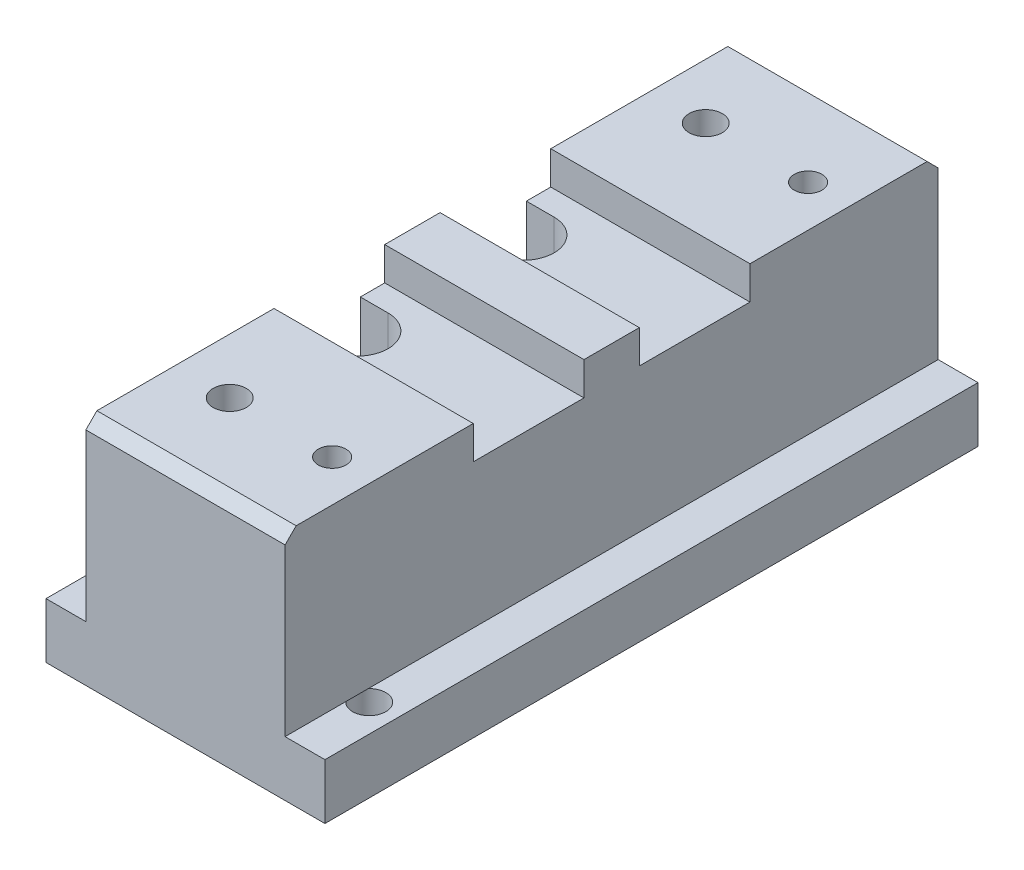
ISO-10303-21;
HEADER;
FILE_DESCRIPTION(('STEP AP214'),'2;1');
FILE_NAME('part.step','',(''),(''),'','','');
FILE_SCHEMA(('AUTOMOTIVE_DESIGN { 1 0 10303 214 1 1 1 1 }'));
ENDSEC;
DATA;
#1=APPLICATION_CONTEXT('core data for automotive mechanical design processes');
#2=APPLICATION_PROTOCOL_DEFINITION('international standard','automotive_design',2000,#1);
#3=PRODUCT_CONTEXT('',#1,'mechanical');
#4=PRODUCT('Part','Part','',(#3));
#5=PRODUCT_RELATED_PRODUCT_CATEGORY('part','',(#4));
#6=PRODUCT_DEFINITION_FORMATION('','',#4);
#7=PRODUCT_DEFINITION_CONTEXT('part definition',#1,'design');
#8=PRODUCT_DEFINITION('design','',#6,#7);
#9=PRODUCT_DEFINITION_SHAPE('','',#8);
#10=(LENGTH_UNIT() NAMED_UNIT(*) SI_UNIT(.MILLI.,.METRE.));
#11=(NAMED_UNIT(*) PLANE_ANGLE_UNIT() SI_UNIT($,.RADIAN.));
#12=(NAMED_UNIT(*) SI_UNIT($,.STERADIAN.) SOLID_ANGLE_UNIT());
#13=UNCERTAINTY_MEASURE_WITH_UNIT(LENGTH_MEASURE(1.E-05),#10,'distance_accuracy_value','');
#14=(GEOMETRIC_REPRESENTATION_CONTEXT(3) GLOBAL_UNCERTAINTY_ASSIGNED_CONTEXT((#13)) GLOBAL_UNIT_ASSIGNED_CONTEXT((#10,
#11,#12)) REPRESENTATION_CONTEXT('',''));
#15=CARTESIAN_POINT('',(0.,0.,0.));
#16=DIRECTION('',(0.,0.,1.));
#17=DIRECTION('',(1.,0.,0.));
#18=AXIS2_PLACEMENT_3D('',#15,#16,#17);
#19=CARTESIAN_POINT('',(-17.0505738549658,7.15649074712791,-42.));
#20=DIRECTION('',(0.,1.,0.));
#21=DIRECTION('',(-1.,0.,0.));
#22=AXIS2_PLACEMENT_3D('',#19,#20,#21);
#23=CYLINDRICAL_SURFACE('',#22,2.8);
#24=CARTESIAN_POINT('',(-17.0505738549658,7.15649074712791,-42.));
#25=DIRECTION('',(0.,1.,0.));
#26=DIRECTION('',(-1.,0.,0.));
#27=AXIS2_PLACEMENT_3D('',#24,#25,#26);
#28=CIRCLE('',#27,2.8);
#29=CARTESIAN_POINT('',(-19.8505738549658,7.15649074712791,-42.));
#30=VERTEX_POINT('',#29);
#31=EDGE_CURVE('E450',#30,#30,#28,.T.);
#32=ORIENTED_EDGE('',*,*,#31,.F.);
#33=EDGE_LOOP('',(#32));
#34=FACE_BOUND('',#33,.T.);
#35=DIRECTION('',(0.,1.,0.));
#36=VECTOR('',#35,1.);
#37=CARTESIAN_POINT('',(-17.0505738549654,12.1564907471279,-39.2));
#38=LINE('',#37,#36);
#39=CARTESIAN_POINT('',(-17.0505738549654,12.1564907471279,-39.2));
#40=VERTEX_POINT('',#39);
#41=CARTESIAN_POINT('',(-17.0505738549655,25.1564907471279,-39.2));
#42=VERTEX_POINT('',#41);
#43=EDGE_CURVE('E232',#40,#42,#38,.T.);
#44=ORIENTED_EDGE('',*,*,#43,.T.);
#45=CARTESIAN_POINT('',(-17.0505738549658,25.1564907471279,-42.));
#46=DIRECTION('',(0.,1.,0.));
#47=DIRECTION('',(-1.,0.,0.));
#48=AXIS2_PLACEMENT_3D('',#45,#46,#47);
#49=CIRCLE('',#48,2.8);
#50=CARTESIAN_POINT('',(-17.0505738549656,25.1564907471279,-44.8));
#51=VERTEX_POINT('',#50);
#52=EDGE_CURVE('E447',#42,#51,#49,.T.);
#53=ORIENTED_EDGE('',*,*,#52,.T.);
#54=DIRECTION('',(0.,1.,0.));
#55=VECTOR('',#54,1.);
#56=CARTESIAN_POINT('',(-17.0505738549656,12.1564907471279,-44.8));
#57=LINE('',#56,#55);
#58=CARTESIAN_POINT('',(-17.0505738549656,12.1564907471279,-44.8));
#59=VERTEX_POINT('',#58);
#60=EDGE_CURVE('E229',#59,#51,#57,.T.);
#61=ORIENTED_EDGE('',*,*,#60,.F.);
#62=CARTESIAN_POINT('',(-17.0505738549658,12.1564907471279,-42.));
#63=DIRECTION('',(0.,-1.,0.));
#64=DIRECTION('',(0.,0.,-1.));
#65=AXIS2_PLACEMENT_3D('',#62,#63,#64);
#66=CIRCLE('',#65,2.8);
#67=EDGE_CURVE('E11',#40,#59,#66,.T.);
#68=ORIENTED_EDGE('',*,*,#67,.F.);
#69=EDGE_LOOP('',(#44,#53,#61,#68));
#70=FACE_BOUND('',#69,.T.);
#71=ADVANCED_FACE('F16',(#34,#70),#23,.F.);
#72=CARTESIAN_POINT('',(-17.0505738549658,7.15649074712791,-57.));
#73=DIRECTION('',(0.,1.,0.));
#74=DIRECTION('',(-1.,0.,0.));
#75=AXIS2_PLACEMENT_3D('',#72,#73,#74);
#76=CYLINDRICAL_SURFACE('',#75,2.8);
#77=CARTESIAN_POINT('',(-17.0505738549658,7.15649074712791,-57.));
#78=DIRECTION('',(0.,1.,0.));
#79=DIRECTION('',(-1.,0.,0.));
#80=AXIS2_PLACEMENT_3D('',#77,#78,#79);
#81=CIRCLE('',#80,2.8);
#82=CARTESIAN_POINT('',(-19.8505738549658,7.15649074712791,-57.));
#83=VERTEX_POINT('',#82);
#84=EDGE_CURVE('E367',#83,#83,#81,.T.);
#85=ORIENTED_EDGE('',*,*,#84,.F.);
#86=EDGE_LOOP('',(#85));
#87=FACE_BOUND('',#86,.T.);
#88=DIRECTION('',(0.,1.,0.));
#89=VECTOR('',#88,1.);
#90=CARTESIAN_POINT('',(-17.0505738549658,12.1564907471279,-54.2));
#91=LINE('',#90,#89);
#92=CARTESIAN_POINT('',(-17.0505738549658,12.1564907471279,-54.2));
#93=VERTEX_POINT('',#92);
#94=CARTESIAN_POINT('',(-17.0505738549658,25.1564907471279,-54.2));
#95=VERTEX_POINT('',#94);
#96=EDGE_CURVE('E247',#93,#95,#91,.T.);
#97=ORIENTED_EDGE('',*,*,#96,.T.);
#98=CARTESIAN_POINT('',(-17.0505738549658,25.1564907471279,-57.));
#99=DIRECTION('',(0.,1.,0.));
#100=DIRECTION('',(-1.,0.,0.));
#101=AXIS2_PLACEMENT_3D('',#98,#99,#100);
#102=CIRCLE('',#101,2.8);
#103=CARTESIAN_POINT('',(-17.0505738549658,25.1564907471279,-59.8));
#104=VERTEX_POINT('',#103);
#105=EDGE_CURVE('E364',#95,#104,#102,.T.);
#106=ORIENTED_EDGE('',*,*,#105,.T.);
#107=DIRECTION('',(0.,1.,0.));
#108=VECTOR('',#107,1.);
#109=CARTESIAN_POINT('',(-17.0505738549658,12.1564907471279,-59.8));
#110=LINE('',#109,#108);
#111=CARTESIAN_POINT('',(-17.0505738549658,12.1564907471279,-59.8));
#112=VERTEX_POINT('',#111);
#113=EDGE_CURVE('E244',#112,#104,#110,.T.);
#114=ORIENTED_EDGE('',*,*,#113,.F.);
#115=CARTESIAN_POINT('',(-17.0505738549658,12.1564907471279,-57.));
#116=DIRECTION('',(0.,-1.,0.));
#117=DIRECTION('',(0.,0.,-1.));
#118=AXIS2_PLACEMENT_3D('',#115,#116,#117);
#119=CIRCLE('',#118,2.8);
#120=EDGE_CURVE('E24',#93,#112,#119,.T.);
#121=ORIENTED_EDGE('',*,*,#120,.F.);
#122=EDGE_LOOP('',(#97,#106,#114,#121));
#123=FACE_BOUND('',#122,.T.);
#124=ADVANCED_FACE('F362',(#87,#123),#76,.F.);
#125=CARTESIAN_POINT('',(-19.5505738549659,7.15649074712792,-74.));
#126=DIRECTION('',(-1.,0.,0.));
#127=DIRECTION('',(0.,0.,1.));
#128=AXIS2_PLACEMENT_3D('',#125,#126,#127);
#129=PLANE('',#128);
#130=DIRECTION('',(0.,1.,0.));
#131=VECTOR('',#130,1.);
#132=CARTESIAN_POINT('',(-19.5505738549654,12.1564907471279,-39.2));
#133=LINE('',#132,#131);
#134=CARTESIAN_POINT('',(-19.5505738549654,12.1564907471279,-39.2));
#135=VERTEX_POINT('',#134);
#136=CARTESIAN_POINT('',(-19.5505738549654,25.1564907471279,-39.2));
#137=VERTEX_POINT('',#136);
#138=EDGE_CURVE('E235',#135,#137,#133,.T.);
#139=ORIENTED_EDGE('',*,*,#138,.F.);
#140=DIRECTION('',(0.,0.,-1.));
#141=VECTOR('',#140,1.);
#142=CARTESIAN_POINT('',(-19.5505738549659,12.1564907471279,-74.));
#143=LINE('',#142,#141);
#144=CARTESIAN_POINT('',(-19.5505738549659,12.1564907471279,-20.));
#145=VERTEX_POINT('',#144);
#146=EDGE_CURVE('E474',#145,#135,#143,.T.);
#147=ORIENTED_EDGE('',*,*,#146,.F.);
#148=DIRECTION('',(0.,-1.,0.));
#149=VECTOR('',#148,1.);
#150=CARTESIAN_POINT('',(-19.5505738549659,7.15649074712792,-20.));
#151=LINE('',#150,#149);
#152=CARTESIAN_POINT('',(-19.5505738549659,27.1564907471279,-20.));
#153=VERTEX_POINT('',#152);
#154=EDGE_CURVE('E288',#153,#145,#151,.T.);
#155=ORIENTED_EDGE('',*,*,#154,.F.);
#156=DIRECTION('',(0.,0.707106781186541,-0.707106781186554));
#157=VECTOR('',#156,1.);
#158=CARTESIAN_POINT('',(-19.5505738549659,44.1564907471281,-37.0000000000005));
#159=LINE('',#158,#157);
#160=CARTESIAN_POINT('',(-19.5505738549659,28.1564907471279,-21.));
#161=VERTEX_POINT('',#160);
#162=EDGE_CURVE('E331',#153,#161,#159,.T.);
#163=ORIENTED_EDGE('',*,*,#162,.T.);
#164=DIRECTION('',(0.,0.,1.));
#165=VECTOR('',#164,1.);
#166=CARTESIAN_POINT('',(-19.5505738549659,28.1564907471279,-74.));
#167=LINE('',#166,#165);
#168=CARTESIAN_POINT('',(-19.5505738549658,28.1564907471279,-37.));
#169=VERTEX_POINT('',#168);
#170=EDGE_CURVE('E399',#169,#161,#167,.T.);
#171=ORIENTED_EDGE('',*,*,#170,.F.);
#172=DIRECTION('',(0.,1.,0.));
#173=VECTOR('',#172,1.);
#174=CARTESIAN_POINT('',(-19.5505738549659,7.15649074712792,-37.));
#175=LINE('',#174,#173);
#176=CARTESIAN_POINT('',(-19.5505738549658,25.1564907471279,-37.));
#177=VERTEX_POINT('',#176);
#178=EDGE_CURVE('E368',#177,#169,#175,.T.);
#179=ORIENTED_EDGE('',*,*,#178,.F.);
#180=DIRECTION('',(0.,0.,-1.));
#181=VECTOR('',#180,1.);
#182=CARTESIAN_POINT('',(-19.5505738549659,25.1564907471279,-74.));
#183=LINE('',#182,#181);
#184=EDGE_CURVE('E452',#177,#137,#183,.T.);
#185=ORIENTED_EDGE('',*,*,#184,.T.);
#186=EDGE_LOOP('',(#139,#147,#155,#163,#171,#179,#185));
#187=FACE_BOUND('',#186,.T.);
#188=ADVANCED_FACE('F516',(#187),#129,.T.);
#189=DIRECTION('',(0.,1.,0.));
#190=VECTOR('',#189,1.);
#191=CARTESIAN_POINT('',(-19.5505738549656,12.1564907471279,-44.8));
#192=LINE('',#191,#190);
#193=CARTESIAN_POINT('',(-19.5505738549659,12.1564907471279,-44.8));
#194=VERTEX_POINT('',#193);
#195=CARTESIAN_POINT('',(-19.5505738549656,25.1564907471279,-44.8));
#196=VERTEX_POINT('',#195);
#197=EDGE_CURVE('E226',#194,#196,#192,.T.);
#198=ORIENTED_EDGE('',*,*,#197,.T.);
#199=CARTESIAN_POINT('',(-19.5505738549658,25.1564907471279,-47.));
#200=VERTEX_POINT('',#199);
#201=EDGE_CURVE('E442',#196,#200,#183,.T.);
#202=ORIENTED_EDGE('',*,*,#201,.T.);
#203=DIRECTION('',(0.,-1.,0.));
#204=VECTOR('',#203,1.);
#205=CARTESIAN_POINT('',(-19.5505738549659,7.15649074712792,-47.));
#206=LINE('',#205,#204);
#207=CARTESIAN_POINT('',(-19.5505738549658,28.1564907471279,-47.));
#208=VERTEX_POINT('',#207);
#209=EDGE_CURVE('E373',#208,#200,#206,.T.);
#210=ORIENTED_EDGE('',*,*,#209,.F.);
#211=CARTESIAN_POINT('',(-19.5505738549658,28.1564907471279,-52.));
#212=VERTEX_POINT('',#211);
#213=EDGE_CURVE('E398',#212,#208,#167,.T.);
#214=ORIENTED_EDGE('',*,*,#213,.F.);
#215=DIRECTION('',(0.,1.,0.));
#216=VECTOR('',#215,1.);
#217=CARTESIAN_POINT('',(-19.5505738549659,7.15649074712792,-52.));
#218=LINE('',#217,#216);
#219=CARTESIAN_POINT('',(-19.5505738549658,25.1564907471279,-52.));
#220=VERTEX_POINT('',#219);
#221=EDGE_CURVE('E387',#220,#212,#218,.T.);
#222=ORIENTED_EDGE('',*,*,#221,.F.);
#223=DIRECTION('',(0.,0.,-1.));
#224=VECTOR('',#223,1.);
#225=CARTESIAN_POINT('',(-19.5505738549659,25.1564907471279,-74.));
#226=LINE('',#225,#224);
#227=CARTESIAN_POINT('',(-19.5505738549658,25.1564907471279,-54.2));
#228=VERTEX_POINT('',#227);
#229=EDGE_CURVE('E408',#220,#228,#226,.T.);
#230=ORIENTED_EDGE('',*,*,#229,.T.);
#231=DIRECTION('',(0.,1.,0.));
#232=VECTOR('',#231,1.);
#233=CARTESIAN_POINT('',(-19.5505738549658,12.1564907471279,-54.2));
#234=LINE('',#233,#232);
#235=CARTESIAN_POINT('',(-19.5505738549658,12.1564907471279,-54.2));
#236=VERTEX_POINT('',#235);
#237=EDGE_CURVE('E251',#236,#228,#234,.T.);
#238=ORIENTED_EDGE('',*,*,#237,.F.);
#239=EDGE_CURVE('E476',#194,#236,#143,.T.);
#240=ORIENTED_EDGE('',*,*,#239,.F.);
#241=EDGE_LOOP('',(#198,#202,#210,#214,#222,#230,#238,#240));
#242=FACE_BOUND('',#241,.T.);
#243=ADVANCED_FACE('F458',(#242),#129,.T.);
#244=DIRECTION('',(0.,1.,0.));
#245=VECTOR('',#244,1.);
#246=CARTESIAN_POINT('',(-19.5505738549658,12.1564907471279,-59.8));
#247=LINE('',#246,#245);
#248=CARTESIAN_POINT('',(-19.5505738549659,12.1564907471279,-59.8));
#249=VERTEX_POINT('',#248);
#250=CARTESIAN_POINT('',(-19.5505738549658,25.1564907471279,-59.8));
#251=VERTEX_POINT('',#250);
#252=EDGE_CURVE('E253',#249,#251,#247,.T.);
#253=ORIENTED_EDGE('',*,*,#252,.T.);
#254=CARTESIAN_POINT('',(-19.5505738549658,25.1564907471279,-62.));
#255=VERTEX_POINT('',#254);
#256=EDGE_CURVE('E407',#251,#255,#226,.T.);
#257=ORIENTED_EDGE('',*,*,#256,.T.);
#258=DIRECTION('',(0.,-1.,0.));
#259=VECTOR('',#258,1.);
#260=CARTESIAN_POINT('',(-19.5505738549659,7.15649074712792,-62.));
#261=LINE('',#260,#259);
#262=CARTESIAN_POINT('',(-19.5505738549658,28.1564907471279,-62.));
#263=VERTEX_POINT('',#262);
#264=EDGE_CURVE('E381',#263,#255,#261,.T.);
#265=ORIENTED_EDGE('',*,*,#264,.F.);
#266=CARTESIAN_POINT('',(-19.5505738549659,28.1564907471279,-78.));
#267=VERTEX_POINT('',#266);
#268=EDGE_CURVE('E395',#267,#263,#167,.T.);
#269=ORIENTED_EDGE('',*,*,#268,.F.);
#270=DIRECTION('',(0.,-0.707106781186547,-0.707106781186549));
#271=VECTOR('',#270,1.);
#272=CARTESIAN_POINT('',(-19.5505738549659,19.656490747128,-86.5));
#273=LINE('',#272,#271);
#274=CARTESIAN_POINT('',(-19.5505738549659,27.1564907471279,-79.));
#275=VERTEX_POINT('',#274);
#276=EDGE_CURVE('E350',#267,#275,#273,.T.);
#277=ORIENTED_EDGE('',*,*,#276,.T.);
#278=DIRECTION('',(0.,1.,0.));
#279=VECTOR('',#278,1.);
#280=CARTESIAN_POINT('',(-19.5505738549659,7.15649074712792,-79.));
#281=LINE('',#280,#279);
#282=CARTESIAN_POINT('',(-19.5505738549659,12.1564907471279,-79.));
#283=VERTEX_POINT('',#282);
#284=EDGE_CURVE('E270',#283,#275,#281,.T.);
#285=ORIENTED_EDGE('',*,*,#284,.F.);
#286=EDGE_CURVE('E303',#249,#283,#143,.T.);
#287=ORIENTED_EDGE('',*,*,#286,.F.);
#288=EDGE_LOOP('',(#253,#257,#265,#269,#277,#285,#287));
#289=FACE_BOUND('',#288,.T.);
#290=ADVANCED_FACE('F482',(#289),#129,.T.);
#291=CARTESIAN_POINT('',(-1.55057385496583,28.1564907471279,-74.));
#292=DIRECTION('',(0.,1.,0.));
#293=DIRECTION('',(-1.,0.,0.));
#294=AXIS2_PLACEMENT_3D('',#291,#292,#293);
#295=PLANE('',#294);
#296=CARTESIAN_POINT('',(-14.5505738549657,28.1564907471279,-28.));
#297=DIRECTION('',(0.,1.,0.));
#298=DIRECTION('',(0.,0.,1.));
#299=AXIS2_PLACEMENT_3D('',#296,#297,#298);
#300=CIRCLE('',#299,1.5);
#301=CARTESIAN_POINT('',(-14.5505738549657,28.1564907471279,-26.5));
#302=VERTEX_POINT('',#301);
#303=EDGE_CURVE('E874',#302,#302,#300,.T.);
#304=ORIENTED_EDGE('',*,*,#303,.F.);
#305=EDGE_LOOP('',(#304));
#306=FACE_BOUND('',#305,.T.);
#307=CARTESIAN_POINT('',(-5.30057385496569,28.1564907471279,-28.));
#308=DIRECTION('',(0.,1.,0.));
#309=DIRECTION('',(0.,0.,1.));
#310=AXIS2_PLACEMENT_3D('',#307,#308,#309);
#311=CIRCLE('',#310,1.25);
#312=CARTESIAN_POINT('',(-5.30057385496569,28.1564907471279,-26.75));
#313=VERTEX_POINT('',#312);
#314=EDGE_CURVE('E208',#313,#313,#311,.T.);
#315=ORIENTED_EDGE('',*,*,#314,.F.);
#316=EDGE_LOOP('',(#315));
#317=FACE_BOUND('',#316,.T.);
#318=ORIENTED_EDGE('',*,*,#170,.T.);
#319=DIRECTION('',(1.,0.,0.));
#320=VECTOR('',#319,1.);
#321=CARTESIAN_POINT('',(-1.55057385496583,28.1564907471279,-21.));
#322=LINE('',#321,#320);
#323=CARTESIAN_POINT('',(-1.55057385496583,28.1564907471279,-21.));
#324=VERTEX_POINT('',#323);
#325=EDGE_CURVE('E333',#161,#324,#322,.T.);
#326=ORIENTED_EDGE('',*,*,#325,.T.);
#327=DIRECTION('',(0.,0.,1.));
#328=VECTOR('',#327,1.);
#329=CARTESIAN_POINT('',(-1.55057385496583,28.1564907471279,-74.));
#330=LINE('',#329,#328);
#331=CARTESIAN_POINT('',(-1.55057385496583,28.1564907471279,-37.));
#332=VERTEX_POINT('',#331);
#333=EDGE_CURVE('E394',#332,#324,#330,.T.);
#334=ORIENTED_EDGE('',*,*,#333,.F.);
#335=DIRECTION('',(1.,0.,0.));
#336=VECTOR('',#335,1.);
#337=CARTESIAN_POINT('',(1.41247190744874,28.1564907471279,-37.));
#338=LINE('',#337,#336);
#339=EDGE_CURVE('E426',#169,#332,#338,.T.);
#340=ORIENTED_EDGE('',*,*,#339,.F.);
#341=EDGE_LOOP('',(#318,#326,#334,#340));
#342=FACE_BOUND('',#341,.T.);
#343=ADVANCED_FACE('F539',(#306,#317,#342),#295,.T.);
#344=DIRECTION('',(-1.,0.,0.));
#345=VECTOR('',#344,1.);
#346=CARTESIAN_POINT('',(1.41247190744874,28.1564907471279,-47.));
#347=LINE('',#346,#345);
#348=CARTESIAN_POINT('',(-1.55057385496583,28.1564907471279,-47.));
#349=VERTEX_POINT('',#348);
#350=EDGE_CURVE('E444',#349,#208,#347,.T.);
#351=ORIENTED_EDGE('',*,*,#350,.F.);
#352=CARTESIAN_POINT('',(-1.55057385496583,28.1564907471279,-52.));
#353=VERTEX_POINT('',#352);
#354=EDGE_CURVE('E402',#353,#349,#330,.T.);
#355=ORIENTED_EDGE('',*,*,#354,.F.);
#356=DIRECTION('',(1.,0.,0.));
#357=VECTOR('',#356,1.);
#358=CARTESIAN_POINT('',(-1.55057385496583,28.1564907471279,-52.));
#359=LINE('',#358,#357);
#360=EDGE_CURVE('E405',#212,#353,#359,.T.);
#361=ORIENTED_EDGE('',*,*,#360,.F.);
#362=ORIENTED_EDGE('',*,*,#213,.T.);
#363=EDGE_LOOP('',(#351,#355,#361,#362));
#364=FACE_BOUND('',#363,.T.);
#365=ADVANCED_FACE('F505',(#364),#295,.T.);
#366=CARTESIAN_POINT('',(-1.55057385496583,7.15649074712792,-74.));
#367=DIRECTION('',(1.,0.,0.));
#368=DIRECTION('',(0.,0.,-1.));
#369=AXIS2_PLACEMENT_3D('',#366,#367,#368);
#370=PLANE('',#369);
#371=DIRECTION('',(0.,-1.,0.));
#372=VECTOR('',#371,1.);
#373=CARTESIAN_POINT('',(-1.55057385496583,7.15649074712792,-79.));
#374=LINE('',#373,#372);
#375=CARTESIAN_POINT('',(-1.55057385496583,27.1564907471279,-79.));
#376=VERTEX_POINT('',#375);
#377=CARTESIAN_POINT('',(-1.55057385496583,12.1564907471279,-79.));
#378=VERTEX_POINT('',#377);
#379=EDGE_CURVE('E262',#376,#378,#374,.T.);
#380=ORIENTED_EDGE('',*,*,#379,.F.);
#381=DIRECTION('',(0.,0.707106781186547,0.707106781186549));
#382=VECTOR('',#381,1.);
#383=CARTESIAN_POINT('',(-1.55057385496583,19.656490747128,-86.5));
#384=LINE('',#383,#382);
#385=CARTESIAN_POINT('',(-1.55057385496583,28.1564907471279,-78.));
#386=VERTEX_POINT('',#385);
#387=EDGE_CURVE('E342',#376,#386,#384,.T.);
#388=ORIENTED_EDGE('',*,*,#387,.T.);
#389=CARTESIAN_POINT('',(-1.55057385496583,28.1564907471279,-62.));
#390=VERTEX_POINT('',#389);
#391=EDGE_CURVE('E400',#386,#390,#330,.T.);
#392=ORIENTED_EDGE('',*,*,#391,.T.);
#393=DIRECTION('',(0.,1.,0.));
#394=VECTOR('',#393,1.);
#395=CARTESIAN_POINT('',(-1.55057385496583,7.15649074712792,-62.));
#396=LINE('',#395,#394);
#397=CARTESIAN_POINT('',(-1.55057385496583,25.1564907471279,-62.));
#398=VERTEX_POINT('',#397);
#399=EDGE_CURVE('E384',#398,#390,#396,.T.);
#400=ORIENTED_EDGE('',*,*,#399,.F.);
#401=DIRECTION('',(0.,0.,1.));
#402=VECTOR('',#401,1.);
#403=CARTESIAN_POINT('',(-1.55057385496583,25.1564907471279,-74.));
#404=LINE('',#403,#402);
#405=CARTESIAN_POINT('',(-1.55057385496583,25.1564907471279,-52.));
#406=VERTEX_POINT('',#405);
#407=EDGE_CURVE('E391',#398,#406,#404,.T.);
#408=ORIENTED_EDGE('',*,*,#407,.T.);
#409=DIRECTION('',(0.,-1.,0.));
#410=VECTOR('',#409,1.);
#411=CARTESIAN_POINT('',(-1.55057385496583,7.15649074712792,-52.));
#412=LINE('',#411,#410);
#413=EDGE_CURVE('E389',#353,#406,#412,.T.);
#414=ORIENTED_EDGE('',*,*,#413,.F.);
#415=ORIENTED_EDGE('',*,*,#354,.T.);
#416=DIRECTION('',(0.,1.,0.));
#417=VECTOR('',#416,1.);
#418=CARTESIAN_POINT('',(-1.55057385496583,7.15649074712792,-47.));
#419=LINE('',#418,#417);
#420=CARTESIAN_POINT('',(-1.55057385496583,25.1564907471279,-47.));
#421=VERTEX_POINT('',#420);
#422=EDGE_CURVE('E413',#421,#349,#419,.T.);
#423=ORIENTED_EDGE('',*,*,#422,.F.);
#424=DIRECTION('',(0.,0.,1.));
#425=VECTOR('',#424,1.);
#426=CARTESIAN_POINT('',(-1.55057385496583,25.1564907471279,-74.));
#427=LINE('',#426,#425);
#428=CARTESIAN_POINT('',(-1.55057385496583,25.1564907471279,-37.));
#429=VERTEX_POINT('',#428);
#430=EDGE_CURVE('E411',#421,#429,#427,.T.);
#431=ORIENTED_EDGE('',*,*,#430,.T.);
#432=DIRECTION('',(0.,-1.,0.));
#433=VECTOR('',#432,1.);
#434=CARTESIAN_POINT('',(-1.55057385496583,7.15649074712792,-37.));
#435=LINE('',#434,#433);
#436=EDGE_CURVE('E318',#332,#429,#435,.T.);
#437=ORIENTED_EDGE('',*,*,#436,.F.);
#438=ORIENTED_EDGE('',*,*,#333,.T.);
#439=DIRECTION('',(0.,-0.707106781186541,0.707106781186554));
#440=VECTOR('',#439,1.);
#441=CARTESIAN_POINT('',(-1.55057385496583,44.1564907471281,-37.0000000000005));
#442=LINE('',#441,#440);
#443=CARTESIAN_POINT('',(-1.55057385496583,27.156490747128,-20.));
#444=VERTEX_POINT('',#443);
#445=EDGE_CURVE('E335',#324,#444,#442,.T.);
#446=ORIENTED_EDGE('',*,*,#445,.T.);
#447=DIRECTION('',(0.,1.,0.));
#448=VECTOR('',#447,1.);
#449=CARTESIAN_POINT('',(-1.55057385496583,7.15649074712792,-20.));
#450=LINE('',#449,#448);
#451=CARTESIAN_POINT('',(-1.55057385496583,12.1564907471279,-20.));
#452=VERTEX_POINT('',#451);
#453=EDGE_CURVE('E279',#452,#444,#450,.T.);
#454=ORIENTED_EDGE('',*,*,#453,.F.);
#455=DIRECTION('',(0.,0.,1.));
#456=VECTOR('',#455,1.);
#457=CARTESIAN_POINT('',(-1.55057385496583,12.1564907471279,-20.));
#458=LINE('',#457,#456);
#459=CARTESIAN_POINT('',(-1.55057385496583,12.1564907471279,-25.4801960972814));
#460=VERTEX_POINT('',#459);
#461=EDGE_CURVE('E294',#460,#452,#458,.T.);
#462=ORIENTED_EDGE('',*,*,#461,.F.);
#463=CARTESIAN_POINT('',(-1.55057385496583,12.1564907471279,-27.5198039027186));
#464=VERTEX_POINT('',#463);
#465=EDGE_CURVE('E315',#464,#460,#458,.T.);
#466=ORIENTED_EDGE('',*,*,#465,.F.);
#467=EDGE_CURVE('E301',#378,#464,#458,.T.);
#468=ORIENTED_EDGE('',*,*,#467,.F.);
#469=EDGE_LOOP('',(#380,#388,#392,#400,#408,#414,#415,#423,#431,#437,#438,#446,#454,#462,#466,#468));
#470=FACE_BOUND('',#469,.T.);
#471=ADVANCED_FACE('F430',(#470),#370,.T.);
#472=CARTESIAN_POINT('',(-1.55057385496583,7.15649074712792,-74.));
#473=DIRECTION('',(0.,-1.,0.));
#474=DIRECTION('',(0.,0.,-1.));
#475=AXIS2_PLACEMENT_3D('',#472,#473,#474);
#476=PLANE('',#475);
#477=ORIENTED_EDGE('',*,*,#31,.T.);
#478=EDGE_LOOP('',(#477));
#479=FACE_BOUND('',#478,.T.);
#480=ORIENTED_EDGE('',*,*,#84,.T.);
#481=EDGE_LOOP('',(#480));
#482=FACE_BOUND('',#481,.T.);
#483=DIRECTION('',(1.,0.,0.));
#484=VECTOR('',#483,1.);
#485=CARTESIAN_POINT('',(-31.4525845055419,7.15649074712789,-79.));
#486=LINE('',#485,#484);
#487=CARTESIAN_POINT('',(-23.1505738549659,7.15649074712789,-79.));
#488=VERTEX_POINT('',#487);
#489=CARTESIAN_POINT('',(2.04942614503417,7.1564907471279,-79.));
#490=VERTEX_POINT('',#489);
#491=EDGE_CURVE('E250',#488,#490,#486,.T.);
#492=ORIENTED_EDGE('',*,*,#491,.T.);
#493=DIRECTION('',(0.,0.,-1.));
#494=VECTOR('',#493,1.);
#495=CARTESIAN_POINT('',(2.04942614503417,7.15649074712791,-20.));
#496=LINE('',#495,#494);
#497=CARTESIAN_POINT('',(2.04942614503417,7.15649074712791,-20.));
#498=VERTEX_POINT('',#497);
#499=EDGE_CURVE('E297',#498,#490,#496,.T.);
#500=ORIENTED_EDGE('',*,*,#499,.F.);
#501=DIRECTION('',(-1.,0.,0.));
#502=VECTOR('',#501,1.);
#503=CARTESIAN_POINT('',(-27.3931827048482,7.1564907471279,-20.));
#504=LINE('',#503,#502);
#505=CARTESIAN_POINT('',(-23.1505738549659,7.1564907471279,-20.));
#506=VERTEX_POINT('',#505);
#507=EDGE_CURVE('E273',#498,#506,#504,.T.);
#508=ORIENTED_EDGE('',*,*,#507,.T.);
#509=DIRECTION('',(0.,0.,1.));
#510=VECTOR('',#509,1.);
#511=CARTESIAN_POINT('',(-23.1505738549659,7.15649074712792,-74.));
#512=LINE('',#511,#510);
#513=EDGE_CURVE('E306',#488,#506,#512,.T.);
#514=ORIENTED_EDGE('',*,*,#513,.F.);
#515=EDGE_LOOP('',(#492,#500,#508,#514));
#516=FACE_BOUND('',#515,.T.);
#517=CARTESIAN_POINT('',(-0.450573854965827,7.15649074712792,-26.5));
#518=DIRECTION('',(0.,-1.,0.));
#519=DIRECTION('',(0.,0.,-1.));
#520=AXIS2_PLACEMENT_3D('',#517,#518,#519);
#521=CIRCLE('',#520,1.5);
#522=CARTESIAN_POINT('',(-0.450573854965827,7.15649074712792,-28.));
#523=VERTEX_POINT('',#522);
#524=EDGE_CURVE('E290',#523,#523,#521,.T.);
#525=ORIENTED_EDGE('',*,*,#524,.F.);
#526=EDGE_LOOP('',(#525));
#527=FACE_BOUND('',#526,.T.);
#528=ADVANCED_FACE('F536',(#479,#482,#516,#527),#476,.T.);
#529=CARTESIAN_POINT('',(-14.5505738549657,28.1564907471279,-71.));
#530=DIRECTION('',(0.,1.,0.));
#531=DIRECTION('',(0.,0.,1.));
#532=AXIS2_PLACEMENT_3D('',#529,#530,#531);
#533=CIRCLE('',#532,1.5);
#534=CARTESIAN_POINT('',(-14.5505738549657,28.1564907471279,-69.5));
#535=VERTEX_POINT('',#534);
#536=EDGE_CURVE('E881',#535,#535,#533,.T.);
#537=ORIENTED_EDGE('',*,*,#536,.F.);
#538=EDGE_LOOP('',(#537));
#539=FACE_BOUND('',#538,.T.);
#540=CARTESIAN_POINT('',(-5.30057385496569,28.1564907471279,-71.));
#541=DIRECTION('',(0.,1.,0.));
#542=DIRECTION('',(0.,0.,1.));
#543=AXIS2_PLACEMENT_3D('',#540,#541,#542);
#544=CIRCLE('',#543,1.25);
#545=CARTESIAN_POINT('',(-5.30057385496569,28.1564907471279,-69.75));
#546=VERTEX_POINT('',#545);
#547=EDGE_CURVE('E207',#546,#546,#544,.T.);
#548=ORIENTED_EDGE('',*,*,#547,.F.);
#549=EDGE_LOOP('',(#548));
#550=FACE_BOUND('',#549,.T.);
#551=ORIENTED_EDGE('',*,*,#391,.F.);
#552=DIRECTION('',(-1.,0.,0.));
#553=VECTOR('',#552,1.);
#554=CARTESIAN_POINT('',(-19.5505738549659,28.1564907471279,-78.));
#555=LINE('',#554,#553);
#556=EDGE_CURVE('E346',#386,#267,#555,.T.);
#557=ORIENTED_EDGE('',*,*,#556,.T.);
#558=ORIENTED_EDGE('',*,*,#268,.T.);
#559=DIRECTION('',(-1.,0.,0.));
#560=VECTOR('',#559,1.);
#561=CARTESIAN_POINT('',(-1.55057385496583,28.1564907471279,-62.));
#562=LINE('',#561,#560);
#563=EDGE_CURVE('E397',#390,#263,#562,.T.);
#564=ORIENTED_EDGE('',*,*,#563,.F.);
#565=EDGE_LOOP('',(#551,#557,#558,#564));
#566=FACE_BOUND('',#565,.T.);
#567=ADVANCED_FACE('F493',(#539,#550,#566),#295,.T.);
#568=CARTESIAN_POINT('',(1.41247190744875,25.1564907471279,-52.));
#569=DIRECTION('',(0.,0.,1.));
#570=DIRECTION('',(1.,0.,0.));
#571=AXIS2_PLACEMENT_3D('',#568,#569,#570);
#572=PLANE('',#571);
#573=ORIENTED_EDGE('',*,*,#413,.T.);
#574=DIRECTION('',(1.,0.,0.));
#575=VECTOR('',#574,1.);
#576=CARTESIAN_POINT('',(1.41247190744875,25.1564907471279,-52.));
#577=LINE('',#576,#575);
#578=EDGE_CURVE('E378',#220,#406,#577,.T.);
#579=ORIENTED_EDGE('',*,*,#578,.F.);
#580=ORIENTED_EDGE('',*,*,#221,.T.);
#581=ORIENTED_EDGE('',*,*,#360,.T.);
#582=EDGE_LOOP('',(#573,#579,#580,#581));
#583=FACE_BOUND('',#582,.T.);
#584=ADVANCED_FACE('F526',(#583),#572,.F.);
#585=CARTESIAN_POINT('',(1.41247190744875,25.1564907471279,-62.));
#586=DIRECTION('',(0.,0.,-1.));
#587=DIRECTION('',(-1.,0.,0.));
#588=AXIS2_PLACEMENT_3D('',#585,#586,#587);
#589=PLANE('',#588);
#590=ORIENTED_EDGE('',*,*,#399,.T.);
#591=ORIENTED_EDGE('',*,*,#563,.T.);
#592=ORIENTED_EDGE('',*,*,#264,.T.);
#593=DIRECTION('',(-1.,0.,0.));
#594=VECTOR('',#593,1.);
#595=CARTESIAN_POINT('',(1.41247190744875,25.1564907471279,-62.));
#596=LINE('',#595,#594);
#597=EDGE_CURVE('E371',#398,#255,#596,.T.);
#598=ORIENTED_EDGE('',*,*,#597,.F.);
#599=EDGE_LOOP('',(#590,#591,#592,#598));
#600=FACE_BOUND('',#599,.T.);
#601=ADVANCED_FACE('F495',(#600),#589,.F.);
#602=CARTESIAN_POINT('',(1.41247190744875,25.1564907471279,-62.));
#603=DIRECTION('',(0.,1.,0.));
#604=DIRECTION('',(-1.,0.,0.));
#605=AXIS2_PLACEMENT_3D('',#602,#603,#604);
#606=PLANE('',#605);
#607=DIRECTION('',(1.,0.,0.));
#608=VECTOR('',#607,1.);
#609=CARTESIAN_POINT('',(-17.0505738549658,25.1564907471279,-54.2));
#610=LINE('',#609,#608);
#611=EDGE_CURVE('E241',#228,#95,#610,.T.);
#612=ORIENTED_EDGE('',*,*,#611,.F.);
#613=ORIENTED_EDGE('',*,*,#229,.F.);
#614=ORIENTED_EDGE('',*,*,#578,.T.);
#615=ORIENTED_EDGE('',*,*,#407,.F.);
#616=ORIENTED_EDGE('',*,*,#597,.T.);
#617=ORIENTED_EDGE('',*,*,#256,.F.);
#618=DIRECTION('',(-1.,0.,0.));
#619=VECTOR('',#618,1.);
#620=CARTESIAN_POINT('',(-17.0505738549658,25.1564907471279,-59.8));
#621=LINE('',#620,#619);
#622=EDGE_CURVE('E231',#104,#251,#621,.T.);
#623=ORIENTED_EDGE('',*,*,#622,.F.);
#624=ORIENTED_EDGE('',*,*,#105,.F.);
#625=EDGE_LOOP('',(#612,#613,#614,#615,#616,#617,#623,#624));
#626=FACE_BOUND('',#625,.T.);
#627=ADVANCED_FACE('F498',(#626),#606,.T.);
#628=CARTESIAN_POINT('',(1.41247190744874,25.1564907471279,-37.));
#629=DIRECTION('',(0.,0.,1.));
#630=DIRECTION('',(1.,0.,0.));
#631=AXIS2_PLACEMENT_3D('',#628,#629,#630);
#632=PLANE('',#631);
#633=ORIENTED_EDGE('',*,*,#178,.T.);
#634=ORIENTED_EDGE('',*,*,#339,.T.);
#635=ORIENTED_EDGE('',*,*,#436,.T.);
#636=DIRECTION('',(1.,0.,0.));
#637=VECTOR('',#636,1.);
#638=CARTESIAN_POINT('',(1.41247190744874,25.1564907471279,-37.));
#639=LINE('',#638,#637);
#640=EDGE_CURVE('E423',#177,#429,#639,.T.);
#641=ORIENTED_EDGE('',*,*,#640,.F.);
#642=EDGE_LOOP('',(#633,#634,#635,#641));
#643=FACE_BOUND('',#642,.T.);
#644=ADVANCED_FACE('F422',(#643),#632,.F.);
#645=CARTESIAN_POINT('',(1.41247190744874,25.1564907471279,-47.));
#646=DIRECTION('',(0.,0.,-1.));
#647=DIRECTION('',(-1.,0.,0.));
#648=AXIS2_PLACEMENT_3D('',#645,#646,#647);
#649=PLANE('',#648);
#650=ORIENTED_EDGE('',*,*,#209,.T.);
#651=DIRECTION('',(-1.,0.,0.));
#652=VECTOR('',#651,1.);
#653=CARTESIAN_POINT('',(1.41247190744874,25.1564907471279,-47.));
#654=LINE('',#653,#652);
#655=EDGE_CURVE('E437',#421,#200,#654,.T.);
#656=ORIENTED_EDGE('',*,*,#655,.F.);
#657=ORIENTED_EDGE('',*,*,#422,.T.);
#658=ORIENTED_EDGE('',*,*,#350,.T.);
#659=EDGE_LOOP('',(#650,#656,#657,#658));
#660=FACE_BOUND('',#659,.T.);
#661=ADVANCED_FACE('F439',(#660),#649,.F.);
#662=CARTESIAN_POINT('',(1.41247190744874,25.1564907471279,-47.));
#663=DIRECTION('',(0.,1.,0.));
#664=DIRECTION('',(-1.,0.,0.));
#665=AXIS2_PLACEMENT_3D('',#662,#663,#664);
#666=PLANE('',#665);
#667=DIRECTION('',(-1.,0.,0.));
#668=VECTOR('',#667,1.);
#669=CARTESIAN_POINT('',(-17.0505738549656,25.1564907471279,-44.8));
#670=LINE('',#669,#668);
#671=EDGE_CURVE('E220',#51,#196,#670,.T.);
#672=ORIENTED_EDGE('',*,*,#671,.F.);
#673=ORIENTED_EDGE('',*,*,#52,.F.);
#674=DIRECTION('',(1.,0.,0.));
#675=VECTOR('',#674,1.);
#676=CARTESIAN_POINT('',(-17.0505738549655,25.1564907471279,-39.2));
#677=LINE('',#676,#675);
#678=EDGE_CURVE('E223',#137,#42,#677,.T.);
#679=ORIENTED_EDGE('',*,*,#678,.F.);
#680=ORIENTED_EDGE('',*,*,#184,.F.);
#681=ORIENTED_EDGE('',*,*,#640,.T.);
#682=ORIENTED_EDGE('',*,*,#430,.F.);
#683=ORIENTED_EDGE('',*,*,#655,.T.);
#684=ORIENTED_EDGE('',*,*,#201,.F.);
#685=EDGE_LOOP('',(#672,#673,#679,#680,#681,#682,#683,#684));
#686=FACE_BOUND('',#685,.T.);
#687=ADVANCED_FACE('F435',(#686),#666,.T.);
#688=CARTESIAN_POINT('',(-23.1505738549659,12.1564907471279,-74.));
#689=DIRECTION('',(0.,-1.,0.));
#690=DIRECTION('',(0.,0.,-1.));
#691=AXIS2_PLACEMENT_3D('',#688,#689,#690);
#692=PLANE('',#691);
#693=ORIENTED_EDGE('',*,*,#146,.T.);
#694=DIRECTION('',(1.,0.,0.));
#695=VECTOR('',#694,1.);
#696=CARTESIAN_POINT('',(-17.0505738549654,12.1564907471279,-39.2));
#697=LINE('',#696,#695);
#698=EDGE_CURVE('E222',#135,#40,#697,.T.);
#699=ORIENTED_EDGE('',*,*,#698,.T.);
#700=ORIENTED_EDGE('',*,*,#67,.T.);
#701=DIRECTION('',(-1.,0.,0.));
#702=VECTOR('',#701,1.);
#703=CARTESIAN_POINT('',(-17.0505738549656,12.1564907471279,-44.8));
#704=LINE('',#703,#702);
#705=EDGE_CURVE('E30',#59,#194,#704,.T.);
#706=ORIENTED_EDGE('',*,*,#705,.T.);
#707=ORIENTED_EDGE('',*,*,#239,.T.);
#708=DIRECTION('',(1.,0.,0.));
#709=VECTOR('',#708,1.);
#710=CARTESIAN_POINT('',(-17.0505738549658,12.1564907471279,-54.2));
#711=LINE('',#710,#709);
#712=EDGE_CURVE('E240',#236,#93,#711,.T.);
#713=ORIENTED_EDGE('',*,*,#712,.T.);
#714=ORIENTED_EDGE('',*,*,#120,.T.);
#715=DIRECTION('',(-1.,0.,0.));
#716=VECTOR('',#715,1.);
#717=CARTESIAN_POINT('',(-17.0505738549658,12.1564907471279,-59.8));
#718=LINE('',#717,#716);
#719=EDGE_CURVE('E37',#112,#249,#718,.T.);
#720=ORIENTED_EDGE('',*,*,#719,.T.);
#721=ORIENTED_EDGE('',*,*,#286,.T.);
#722=DIRECTION('',(-1.,0.,0.));
#723=VECTOR('',#722,1.);
#724=CARTESIAN_POINT('',(-23.1505738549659,12.1564907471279,-79.));
#725=LINE('',#724,#723);
#726=CARTESIAN_POINT('',(-23.1505738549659,12.1564907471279,-79.));
#727=VERTEX_POINT('',#726);
#728=EDGE_CURVE('E267',#283,#727,#725,.T.);
#729=ORIENTED_EDGE('',*,*,#728,.T.);
#730=DIRECTION('',(0.,0.,-1.));
#731=VECTOR('',#730,1.);
#732=CARTESIAN_POINT('',(-23.1505738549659,12.1564907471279,-74.));
#733=LINE('',#732,#731);
#734=CARTESIAN_POINT('',(-23.1505738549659,12.1564907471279,-20.));
#735=VERTEX_POINT('',#734);
#736=EDGE_CURVE('E469',#735,#727,#733,.T.);
#737=ORIENTED_EDGE('',*,*,#736,.F.);
#738=DIRECTION('',(1.,0.,0.));
#739=VECTOR('',#738,1.);
#740=CARTESIAN_POINT('',(-23.1505738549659,12.1564907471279,-20.));
#741=LINE('',#740,#739);
#742=EDGE_CURVE('E285',#735,#145,#741,.T.);
#743=ORIENTED_EDGE('',*,*,#742,.T.);
#744=EDGE_LOOP('',(#693,#699,#700,#706,#707,#713,#714,#720,#721,#729,#737,#743));
#745=FACE_BOUND('',#744,.T.);
#746=ADVANCED_FACE('F352',(#745),#692,.F.);
#747=CARTESIAN_POINT('',(-23.1505738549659,12.1564907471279,-74.));
#748=DIRECTION('',(1.,0.,0.));
#749=DIRECTION('',(0.,0.,-1.));
#750=AXIS2_PLACEMENT_3D('',#747,#748,#749);
#751=PLANE('',#750);
#752=ORIENTED_EDGE('',*,*,#736,.T.);
#753=DIRECTION('',(0.,-1.,0.));
#754=VECTOR('',#753,1.);
#755=CARTESIAN_POINT('',(-23.1505738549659,12.1564907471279,-79.));
#756=LINE('',#755,#754);
#757=EDGE_CURVE('E264',#727,#488,#756,.T.);
#758=ORIENTED_EDGE('',*,*,#757,.T.);
#759=ORIENTED_EDGE('',*,*,#513,.T.);
#760=DIRECTION('',(0.,1.,0.));
#761=VECTOR('',#760,1.);
#762=CARTESIAN_POINT('',(-23.1505738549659,12.1564907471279,-20.));
#763=LINE('',#762,#761);
#764=EDGE_CURVE('E282',#506,#735,#763,.T.);
#765=ORIENTED_EDGE('',*,*,#764,.T.);
#766=EDGE_LOOP('',(#752,#758,#759,#765));
#767=FACE_BOUND('',#766,.T.);
#768=ADVANCED_FACE('F591',(#767),#751,.F.);
#769=CARTESIAN_POINT('',(2.04942614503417,12.1564907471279,-20.));
#770=DIRECTION('',(0.,-1.,0.));
#771=DIRECTION('',(0.,0.,-1.));
#772=AXIS2_PLACEMENT_3D('',#769,#770,#771);
#773=PLANE('',#772);
#774=DIRECTION('',(0.,0.,1.));
#775=VECTOR('',#774,1.);
#776=CARTESIAN_POINT('',(2.04942614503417,12.1564907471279,-20.));
#777=LINE('',#776,#775);
#778=CARTESIAN_POINT('',(2.04942614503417,12.1564907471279,-79.));
#779=VERTEX_POINT('',#778);
#780=CARTESIAN_POINT('',(2.04942614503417,12.1564907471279,-20.));
#781=VERTEX_POINT('',#780);
#782=EDGE_CURVE('E300',#779,#781,#777,.T.);
#783=ORIENTED_EDGE('',*,*,#782,.F.);
#784=DIRECTION('',(-1.,0.,0.));
#785=VECTOR('',#784,1.);
#786=CARTESIAN_POINT('',(2.04942614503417,12.1564907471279,-79.));
#787=LINE('',#786,#785);
#788=EDGE_CURVE('E259',#779,#378,#787,.T.);
#789=ORIENTED_EDGE('',*,*,#788,.T.);
#790=ORIENTED_EDGE('',*,*,#467,.T.);
#791=CARTESIAN_POINT('',(-0.450573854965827,12.1564907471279,-26.5));
#792=DIRECTION('',(0.,-1.,0.));
#793=DIRECTION('',(0.,0.,-1.));
#794=AXIS2_PLACEMENT_3D('',#791,#792,#793);
#795=CIRCLE('',#794,1.5);
#796=EDGE_CURVE('E322',#464,#460,#795,.T.);
#797=ORIENTED_EDGE('',*,*,#796,.T.);
#798=ORIENTED_EDGE('',*,*,#461,.T.);
#799=DIRECTION('',(1.,0.,0.));
#800=VECTOR('',#799,1.);
#801=CARTESIAN_POINT('',(2.04942614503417,12.1564907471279,-20.));
#802=LINE('',#801,#800);
#803=EDGE_CURVE('E276',#452,#781,#802,.T.);
#804=ORIENTED_EDGE('',*,*,#803,.T.);
#805=EDGE_LOOP('',(#783,#789,#790,#797,#798,#804));
#806=FACE_BOUND('',#805,.T.);
#807=ADVANCED_FACE('F598',(#806),#773,.F.);
#808=CARTESIAN_POINT('',(2.04942614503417,12.1564907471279,-20.));
#809=DIRECTION('',(-1.,0.,0.));
#810=DIRECTION('',(0.,0.,1.));
#811=AXIS2_PLACEMENT_3D('',#808,#809,#810);
#812=PLANE('',#811);
#813=ORIENTED_EDGE('',*,*,#499,.T.);
#814=DIRECTION('',(0.,1.,0.));
#815=VECTOR('',#814,1.);
#816=CARTESIAN_POINT('',(2.04942614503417,12.1564907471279,-79.));
#817=LINE('',#816,#815);
#818=EDGE_CURVE('E336',#490,#779,#817,.T.);
#819=ORIENTED_EDGE('',*,*,#818,.T.);
#820=ORIENTED_EDGE('',*,*,#782,.T.);
#821=DIRECTION('',(0.,-1.,0.));
#822=VECTOR('',#821,1.);
#823=CARTESIAN_POINT('',(2.04942614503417,12.1564907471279,-20.));
#824=LINE('',#823,#822);
#825=EDGE_CURVE('E325',#781,#498,#824,.T.);
#826=ORIENTED_EDGE('',*,*,#825,.T.);
#827=EDGE_LOOP('',(#813,#819,#820,#826));
#828=FACE_BOUND('',#827,.T.);
#829=ADVANCED_FACE('F605',(#828),#812,.F.);
#830=CARTESIAN_POINT('',(-0.450573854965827,12.1564907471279,-26.5));
#831=DIRECTION('',(0.,-1.,0.));
#832=DIRECTION('',(0.,0.,-1.));
#833=AXIS2_PLACEMENT_3D('',#830,#831,#832);
#834=CYLINDRICAL_SURFACE('',#833,1.5);
#835=CARTESIAN_POINT('',(-0.450573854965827,12.1564907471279,-26.5));
#836=DIRECTION('',(0.,-1.,0.));
#837=DIRECTION('',(0.,0.,-1.));
#838=AXIS2_PLACEMENT_3D('',#835,#836,#837);
#839=CIRCLE('',#838,1.5);
#840=EDGE_CURVE('E291',#460,#464,#839,.T.);
#841=ORIENTED_EDGE('',*,*,#840,.F.);
#842=ORIENTED_EDGE('',*,*,#796,.F.);
#843=EDGE_LOOP('',(#841,#842));
#844=FACE_BOUND('',#843,.T.);
#845=ORIENTED_EDGE('',*,*,#524,.T.);
#846=EDGE_LOOP('',(#845));
#847=FACE_BOUND('',#846,.T.);
#848=ADVANCED_FACE('F614',(#844,#847),#834,.F.);
#849=CARTESIAN_POINT('',(-0.450573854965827,12.1564907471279,-26.5));
#850=DIRECTION('',(0.,-1.,0.));
#851=DIRECTION('',(0.,0.,-1.));
#852=AXIS2_PLACEMENT_3D('',#849,#850,#851);
#853=PLANE('',#852);
#854=ORIENTED_EDGE('',*,*,#840,.T.);
#855=ORIENTED_EDGE('',*,*,#465,.T.);
#856=EDGE_LOOP('',(#854,#855));
#857=FACE_BOUND('',#856,.T.);
#858=ADVANCED_FACE('F622',(#857),#853,.T.);
#859=CARTESIAN_POINT('',(-27.3931827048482,7.1564907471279,-20.));
#860=DIRECTION('',(0.,0.,-1.));
#861=DIRECTION('',(-1.,0.,0.));
#862=AXIS2_PLACEMENT_3D('',#859,#860,#861);
#863=PLANE('',#862);
#864=ORIENTED_EDGE('',*,*,#453,.T.);
#865=DIRECTION('',(-1.,0.,0.));
#866=VECTOR('',#865,1.);
#867=CARTESIAN_POINT('',(-19.5505738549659,27.1564907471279,-20.));
#868=LINE('',#867,#866);
#869=EDGE_CURVE('E328',#444,#153,#868,.T.);
#870=ORIENTED_EDGE('',*,*,#869,.T.);
#871=ORIENTED_EDGE('',*,*,#154,.T.);
#872=ORIENTED_EDGE('',*,*,#742,.F.);
#873=ORIENTED_EDGE('',*,*,#764,.F.);
#874=ORIENTED_EDGE('',*,*,#507,.F.);
#875=ORIENTED_EDGE('',*,*,#825,.F.);
#876=ORIENTED_EDGE('',*,*,#803,.F.);
#877=EDGE_LOOP('',(#864,#870,#871,#872,#873,#874,#875,#876));
#878=FACE_BOUND('',#877,.T.);
#879=ADVANCED_FACE('F515',(#878),#863,.F.);
#880=CARTESIAN_POINT('',(-27.3931827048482,27.1564907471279,-20.));
#881=DIRECTION('',(0.,0.707106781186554,0.707106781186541));
#882=DIRECTION('',(0.,-0.707106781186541,0.707106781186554));
#883=AXIS2_PLACEMENT_3D('',#880,#881,#882);
#884=PLANE('',#883);
#885=ORIENTED_EDGE('',*,*,#445,.F.);
#886=ORIENTED_EDGE('',*,*,#325,.F.);
#887=ORIENTED_EDGE('',*,*,#162,.F.);
#888=ORIENTED_EDGE('',*,*,#869,.F.);
#889=EDGE_LOOP('',(#885,#886,#887,#888));
#890=FACE_BOUND('',#889,.T.);
#891=ADVANCED_FACE('F512',(#890),#884,.T.);
#892=CARTESIAN_POINT('',(-31.4525845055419,7.15649074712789,-79.));
#893=DIRECTION('',(0.,0.,1.));
#894=DIRECTION('',(1.,0.,0.));
#895=AXIS2_PLACEMENT_3D('',#892,#893,#894);
#896=PLANE('',#895);
#897=ORIENTED_EDGE('',*,*,#284,.T.);
#898=DIRECTION('',(1.,0.,0.));
#899=VECTOR('',#898,1.);
#900=CARTESIAN_POINT('',(-1.55057385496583,27.1564907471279,-79.));
#901=LINE('',#900,#899);
#902=EDGE_CURVE('E338',#275,#376,#901,.T.);
#903=ORIENTED_EDGE('',*,*,#902,.T.);
#904=ORIENTED_EDGE('',*,*,#379,.T.);
#905=ORIENTED_EDGE('',*,*,#788,.F.);
#906=ORIENTED_EDGE('',*,*,#818,.F.);
#907=ORIENTED_EDGE('',*,*,#491,.F.);
#908=ORIENTED_EDGE('',*,*,#757,.F.);
#909=ORIENTED_EDGE('',*,*,#728,.F.);
#910=EDGE_LOOP('',(#897,#903,#904,#905,#906,#907,#908,#909));
#911=FACE_BOUND('',#910,.T.);
#912=ADVANCED_FACE('F481',(#911),#896,.F.);
#913=CARTESIAN_POINT('',(-31.4525845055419,27.1564907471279,-79.));
#914=DIRECTION('',(0.,0.707106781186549,-0.707106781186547));
#915=DIRECTION('',(0.,0.707106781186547,0.707106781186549));
#916=AXIS2_PLACEMENT_3D('',#913,#914,#915);
#917=PLANE('',#916);
#918=ORIENTED_EDGE('',*,*,#276,.F.);
#919=ORIENTED_EDGE('',*,*,#556,.F.);
#920=ORIENTED_EDGE('',*,*,#387,.F.);
#921=ORIENTED_EDGE('',*,*,#902,.F.);
#922=EDGE_LOOP('',(#918,#919,#920,#921));
#923=FACE_BOUND('',#922,.T.);
#924=ADVANCED_FACE('F18',(#923),#917,.T.);
#925=CARTESIAN_POINT('',(-17.0505738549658,12.1564907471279,-59.8));
#926=DIRECTION('',(0.,0.,-1.));
#927=DIRECTION('',(-1.,0.,0.));
#928=AXIS2_PLACEMENT_3D('',#925,#926,#927);
#929=PLANE('',#928);
#930=ORIENTED_EDGE('',*,*,#622,.T.);
#931=ORIENTED_EDGE('',*,*,#252,.F.);
#932=ORIENTED_EDGE('',*,*,#719,.F.);
#933=ORIENTED_EDGE('',*,*,#113,.T.);
#934=EDGE_LOOP('',(#930,#931,#932,#933));
#935=FACE_BOUND('',#934,.T.);
#936=ADVANCED_FACE('F358',(#935),#929,.F.);
#937=CARTESIAN_POINT('',(-17.0505738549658,12.1564907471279,-54.2));
#938=DIRECTION('',(0.,0.,1.));
#939=DIRECTION('',(1.,0.,0.));
#940=AXIS2_PLACEMENT_3D('',#937,#938,#939);
#941=PLANE('',#940);
#942=ORIENTED_EDGE('',*,*,#611,.T.);
#943=ORIENTED_EDGE('',*,*,#96,.F.);
#944=ORIENTED_EDGE('',*,*,#712,.F.);
#945=ORIENTED_EDGE('',*,*,#237,.T.);
#946=EDGE_LOOP('',(#942,#943,#944,#945));
#947=FACE_BOUND('',#946,.T.);
#948=ADVANCED_FACE('F524',(#947),#941,.F.);
#949=CARTESIAN_POINT('',(-17.0505738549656,12.1564907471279,-44.8));
#950=DIRECTION('',(0.,0.,-1.));
#951=DIRECTION('',(-1.,0.,0.));
#952=AXIS2_PLACEMENT_3D('',#949,#950,#951);
#953=PLANE('',#952);
#954=ORIENTED_EDGE('',*,*,#671,.T.);
#955=ORIENTED_EDGE('',*,*,#197,.F.);
#956=ORIENTED_EDGE('',*,*,#705,.F.);
#957=ORIENTED_EDGE('',*,*,#60,.T.);
#958=EDGE_LOOP('',(#954,#955,#956,#957));
#959=FACE_BOUND('',#958,.T.);
#960=ADVANCED_FACE('F521',(#959),#953,.F.);
#961=CARTESIAN_POINT('',(-17.0505738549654,12.1564907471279,-39.2));
#962=DIRECTION('',(0.,0.,1.));
#963=DIRECTION('',(1.,0.,0.));
#964=AXIS2_PLACEMENT_3D('',#961,#962,#963);
#965=PLANE('',#964);
#966=ORIENTED_EDGE('',*,*,#678,.T.);
#967=ORIENTED_EDGE('',*,*,#43,.F.);
#968=ORIENTED_EDGE('',*,*,#698,.F.);
#969=ORIENTED_EDGE('',*,*,#138,.T.);
#970=EDGE_LOOP('',(#966,#967,#968,#969));
#971=FACE_BOUND('',#970,.T.);
#972=ADVANCED_FACE('F520',(#971),#965,.F.);
#973=CARTESIAN_POINT('',(-5.30057385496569,15.6564907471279,-71.));
#974=DIRECTION('',(0.,1.,0.));
#975=DIRECTION('',(0.,0.,1.));
#976=AXIS2_PLACEMENT_3D('',#973,#974,#975);
#977=CONICAL_SURFACE('',#976,1.25,1.02974425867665);
#978=CARTESIAN_POINT('',(-5.30057385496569,14.9054149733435,-71.));
#979=VERTEX_POINT('',#978);
#980=VERTEX_LOOP('',#979);
#981=FACE_BOUND('',#980,.T.);
#982=CARTESIAN_POINT('',(-5.30057385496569,15.6564907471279,-71.));
#983=DIRECTION('',(0.,1.,0.));
#984=DIRECTION('',(0.,0.,1.));
#985=AXIS2_PLACEMENT_3D('',#982,#983,#984);
#986=CIRCLE('',#985,1.25);
#987=CARTESIAN_POINT('',(-5.30057385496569,15.6564907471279,-69.75));
#988=VERTEX_POINT('',#987);
#989=EDGE_CURVE('E211',#988,#988,#986,.T.);
#990=ORIENTED_EDGE('',*,*,#989,.T.);
#991=EDGE_LOOP('',(#990));
#992=FACE_BOUND('',#991,.T.);
#993=ADVANCED_FACE('F686',(#981,#992),#977,.F.);
#994=CARTESIAN_POINT('',(-5.30057385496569,28.1564907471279,-71.));
#995=DIRECTION('',(0.,1.,0.));
#996=DIRECTION('',(0.,0.,1.));
#997=AXIS2_PLACEMENT_3D('',#994,#995,#996);
#998=CYLINDRICAL_SURFACE('',#997,1.25);
#999=ORIENTED_EDGE('',*,*,#989,.F.);
#1000=EDGE_LOOP('',(#999));
#1001=FACE_BOUND('',#1000,.T.);
#1002=ORIENTED_EDGE('',*,*,#547,.T.);
#1003=EDGE_LOOP('',(#1002));
#1004=FACE_BOUND('',#1003,.T.);
#1005=ADVANCED_FACE('F201',(#1001,#1004),#998,.F.);
#1006=CARTESIAN_POINT('',(-5.30057385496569,15.6564907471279,-28.));
#1007=DIRECTION('',(0.,1.,0.));
#1008=DIRECTION('',(0.,0.,1.));
#1009=AXIS2_PLACEMENT_3D('',#1006,#1007,#1008);
#1010=CONICAL_SURFACE('',#1009,1.25,1.02974425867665);
#1011=CARTESIAN_POINT('',(-5.30057385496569,14.9054149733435,-28.));
#1012=VERTEX_POINT('',#1011);
#1013=VERTEX_LOOP('',#1012);
#1014=FACE_BOUND('',#1013,.T.);
#1015=CARTESIAN_POINT('',(-5.30057385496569,15.6564907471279,-28.));
#1016=DIRECTION('',(0.,1.,0.));
#1017=DIRECTION('',(0.,0.,1.));
#1018=AXIS2_PLACEMENT_3D('',#1015,#1016,#1017);
#1019=CIRCLE('',#1018,1.25);
#1020=CARTESIAN_POINT('',(-5.30057385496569,15.6564907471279,-26.75));
#1021=VERTEX_POINT('',#1020);
#1022=EDGE_CURVE('E205',#1021,#1021,#1019,.T.);
#1023=ORIENTED_EDGE('',*,*,#1022,.T.);
#1024=EDGE_LOOP('',(#1023));
#1025=FACE_BOUND('',#1024,.T.);
#1026=ADVANCED_FACE('F197',(#1014,#1025),#1010,.F.);
#1027=CARTESIAN_POINT('',(-5.30057385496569,28.1564907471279,-28.));
#1028=DIRECTION('',(0.,1.,0.));
#1029=DIRECTION('',(0.,0.,1.));
#1030=AXIS2_PLACEMENT_3D('',#1027,#1028,#1029);
#1031=CYLINDRICAL_SURFACE('',#1030,1.25);
#1032=ORIENTED_EDGE('',*,*,#1022,.F.);
#1033=EDGE_LOOP('',(#1032));
#1034=FACE_BOUND('',#1033,.T.);
#1035=ORIENTED_EDGE('',*,*,#314,.T.);
#1036=EDGE_LOOP('',(#1035));
#1037=FACE_BOUND('',#1036,.T.);
#1038=ADVANCED_FACE('F200',(#1034,#1037),#1031,.F.);
#1039=CARTESIAN_POINT('',(-14.5505738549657,16.1564907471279,-71.));
#1040=DIRECTION('',(0.,-1.,0.));
#1041=DIRECTION('',(0.,0.,-1.));
#1042=AXIS2_PLACEMENT_3D('',#1039,#1040,#1041);
#1043=PLANE('',#1042);
#1044=CARTESIAN_POINT('',(-14.5505738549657,16.1564907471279,-71.));
#1045=DIRECTION('',(0.,1.,0.));
#1046=DIRECTION('',(0.,0.,1.));
#1047=AXIS2_PLACEMENT_3D('',#1044,#1045,#1046);
#1048=CIRCLE('',#1047,1.5);
#1049=CARTESIAN_POINT('',(-14.5505738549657,16.1564907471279,-69.5));
#1050=VERTEX_POINT('',#1049);
#1051=EDGE_CURVE('E214',#1050,#1050,#1048,.T.);
#1052=ORIENTED_EDGE('',*,*,#1051,.T.);
#1053=EDGE_LOOP('',(#1052));
#1054=FACE_BOUND('',#1053,.T.);
#1055=ADVANCED_FACE('F715',(#1054),#1043,.F.);
#1056=CARTESIAN_POINT('',(-14.5505738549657,28.1564907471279,-71.));
#1057=DIRECTION('',(0.,1.,0.));
#1058=DIRECTION('',(0.,0.,1.));
#1059=AXIS2_PLACEMENT_3D('',#1056,#1057,#1058);
#1060=CYLINDRICAL_SURFACE('',#1059,1.5);
#1061=ORIENTED_EDGE('',*,*,#1051,.F.);
#1062=EDGE_LOOP('',(#1061));
#1063=FACE_BOUND('',#1062,.T.);
#1064=ORIENTED_EDGE('',*,*,#536,.T.);
#1065=EDGE_LOOP('',(#1064));
#1066=FACE_BOUND('',#1065,.T.);
#1067=ADVANCED_FACE('F723',(#1063,#1066),#1060,.F.);
#1068=CARTESIAN_POINT('',(-14.5505738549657,16.1564907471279,-28.));
#1069=DIRECTION('',(0.,-1.,0.));
#1070=DIRECTION('',(0.,0.,-1.));
#1071=AXIS2_PLACEMENT_3D('',#1068,#1069,#1070);
#1072=PLANE('',#1071);
#1073=CARTESIAN_POINT('',(-14.5505738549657,16.1564907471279,-28.));
#1074=DIRECTION('',(0.,1.,0.));
#1075=DIRECTION('',(0.,0.,1.));
#1076=AXIS2_PLACEMENT_3D('',#1073,#1074,#1075);
#1077=CIRCLE('',#1076,1.5);
#1078=CARTESIAN_POINT('',(-14.5505738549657,16.1564907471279,-26.5));
#1079=VERTEX_POINT('',#1078);
#1080=EDGE_CURVE('E878',#1079,#1079,#1077,.T.);
#1081=ORIENTED_EDGE('',*,*,#1080,.T.);
#1082=EDGE_LOOP('',(#1081));
#1083=FACE_BOUND('',#1082,.T.);
#1084=ADVANCED_FACE('F732',(#1083),#1072,.F.);
#1085=CARTESIAN_POINT('',(-14.5505738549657,28.1564907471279,-28.));
#1086=DIRECTION('',(0.,1.,0.));
#1087=DIRECTION('',(0.,0.,1.));
#1088=AXIS2_PLACEMENT_3D('',#1085,#1086,#1087);
#1089=CYLINDRICAL_SURFACE('',#1088,1.5);
#1090=ORIENTED_EDGE('',*,*,#1080,.F.);
#1091=EDGE_LOOP('',(#1090));
#1092=FACE_BOUND('',#1091,.T.);
#1093=ORIENTED_EDGE('',*,*,#303,.T.);
#1094=EDGE_LOOP('',(#1093));
#1095=FACE_BOUND('',#1094,.T.);
#1096=ADVANCED_FACE('F741',(#1092,#1095),#1089,.F.);
#1097=CLOSED_SHELL('',(#71,#124,#188,#243,#290,#343,#365,#471,#528,#567,#584,#601,#627,#644,
#661,#687,#746,#768,#807,#829,#848,#858,#879,#891,#912,#924,#936,#948,#960,#972,#993,#1005,
#1026,#1038,#1055,#1067,#1084,#1096));
#1098=MANIFOLD_SOLID_BREP('B1',#1097);
#1099=ADVANCED_BREP_SHAPE_REPRESENTATION('',(#18,#1098),#14);
#1100=SHAPE_DEFINITION_REPRESENTATION(#9,#1099);
ENDSEC;
END-ISO-10303-21;
